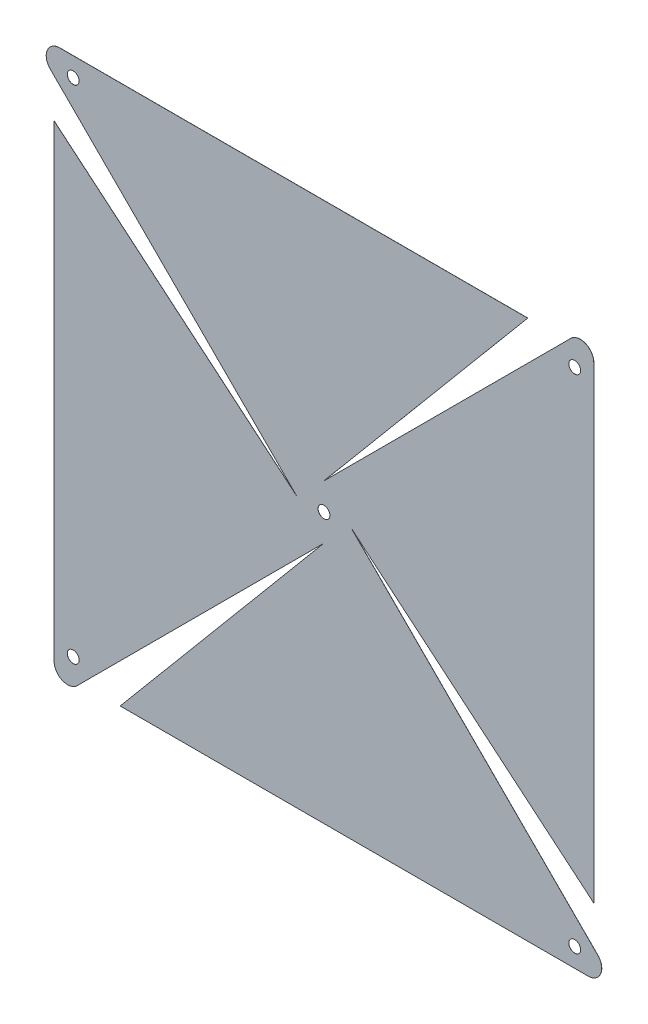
ISO-10303-21;
HEADER;
FILE_DESCRIPTION(('STEP AP214'),'2;1');
FILE_NAME('part.step','',(''),(''),'','','');
FILE_SCHEMA(('AUTOMOTIVE_DESIGN { 1 0 10303 214 1 1 1 1 }'));
ENDSEC;
DATA;
#1=APPLICATION_CONTEXT('core data for automotive mechanical design processes');
#2=APPLICATION_PROTOCOL_DEFINITION('international standard','automotive_design',2000,#1);
#3=PRODUCT_CONTEXT('',#1,'mechanical');
#4=PRODUCT('Part','Part','',(#3));
#5=PRODUCT_RELATED_PRODUCT_CATEGORY('part','',(#4));
#6=PRODUCT_DEFINITION_FORMATION('','',#4);
#7=PRODUCT_DEFINITION_CONTEXT('part definition',#1,'design');
#8=PRODUCT_DEFINITION('design','',#6,#7);
#9=PRODUCT_DEFINITION_SHAPE('','',#8);
#10=(LENGTH_UNIT() NAMED_UNIT(*) SI_UNIT(.MILLI.,.METRE.));
#11=(NAMED_UNIT(*) PLANE_ANGLE_UNIT() SI_UNIT($,.RADIAN.));
#12=(NAMED_UNIT(*) SI_UNIT($,.STERADIAN.) SOLID_ANGLE_UNIT());
#13=UNCERTAINTY_MEASURE_WITH_UNIT(LENGTH_MEASURE(1.E-05),#10,'distance_accuracy_value','');
#14=(GEOMETRIC_REPRESENTATION_CONTEXT(3) GLOBAL_UNCERTAINTY_ASSIGNED_CONTEXT((#13)) GLOBAL_UNIT_ASSIGNED_CONTEXT((#10,
#11,#12)) REPRESENTATION_CONTEXT('',''));
#15=CARTESIAN_POINT('',(0.,0.,0.));
#16=DIRECTION('',(0.,0.,1.));
#17=DIRECTION('',(1.,0.,0.));
#18=AXIS2_PLACEMENT_3D('',#15,#16,#17);
#19=CARTESIAN_POINT('',(0.,0.,0.0254));
#20=DIRECTION('',(0.,0.,1.));
#21=DIRECTION('',(1.,0.,0.));
#22=AXIS2_PLACEMENT_3D('',#19,#20,#21);
#23=PLANE('',#22);
#24=CARTESIAN_POINT('',(-59.0098719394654,-59.0098719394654,0.0254));
#25=DIRECTION('',(0.,0.,1.));
#26=DIRECTION('',(1.,0.,0.));
#27=AXIS2_PLACEMENT_3D('',#24,#25,#26);
#28=CIRCLE('',#27,1.38906249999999);
#29=CARTESIAN_POINT('',(-57.6208094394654,-59.0098719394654,0.0254));
#30=VERTEX_POINT('',#29);
#31=EDGE_CURVE('E428',#30,#30,#28,.T.);
#32=ORIENTED_EDGE('',*,*,#31,.F.);
#33=EDGE_LOOP('',(#32));
#34=FACE_BOUND('',#33,.T.);
#35=CARTESIAN_POINT('',(59.0098719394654,59.0098719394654,0.0254));
#36=DIRECTION('',(0.,0.,1.));
#37=DIRECTION('',(1.,0.,0.));
#38=AXIS2_PLACEMENT_3D('',#35,#36,#37);
#39=CIRCLE('',#38,1.38906249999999);
#40=CARTESIAN_POINT('',(60.3989344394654,59.0098719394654,0.0254));
#41=VERTEX_POINT('',#40);
#42=EDGE_CURVE('E394',#41,#41,#39,.T.);
#43=ORIENTED_EDGE('',*,*,#42,.F.);
#44=EDGE_LOOP('',(#43));
#45=FACE_BOUND('',#44,.T.);
#46=DIRECTION('',(-1.,0.,0.));
#47=VECTOR('',#46,1.);
#48=CARTESIAN_POINT('',(-69.8500000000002,63.5000000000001,0.0254));
#49=LINE('',#48,#47);
#50=CARTESIAN_POINT('',(47.9545439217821,63.5,0.0254));
#51=VERTEX_POINT('',#50);
#52=CARTESIAN_POINT('',(-62.1848719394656,63.5000000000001,0.0254));
#53=VERTEX_POINT('',#52);
#54=EDGE_CURVE('E146',#51,#53,#49,.T.);
#55=ORIENTED_EDGE('',*,*,#54,.T.);
#56=CARTESIAN_POINT('',(-62.1848719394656,60.3250000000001,0.0254));
#57=DIRECTION('',(0.,0.,1.));
#58=DIRECTION('',(1.,0.,0.));
#59=AXIS2_PLACEMENT_3D('',#56,#57,#58);
#60=CIRCLE('',#59,3.175);
#61=CARTESIAN_POINT('',(-64.4299359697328,58.0799359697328,0.0254));
#62=VERTEX_POINT('',#61);
#63=EDGE_CURVE('E194',#53,#62,#60,.T.);
#64=ORIENTED_EDGE('',*,*,#63,.T.);
#65=DIRECTION('',(0.707106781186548,-0.707106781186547,0.));
#66=VECTOR('',#65,1.);
#67=CARTESIAN_POINT('',(-6.35,0.,0.0254));
#68=LINE('',#67,#66);
#69=CARTESIAN_POINT('',(-6.35,0.,0.0254));
#70=VERTEX_POINT('',#69);
#71=EDGE_CURVE('E156',#62,#70,#68,.T.);
#72=ORIENTED_EDGE('',*,*,#71,.T.);
#73=DIRECTION('',(-0.766044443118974,0.642787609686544,0.));
#74=VECTOR('',#73,1.);
#75=CARTESIAN_POINT('',(-6.35,0.,0.0254));
#76=LINE('',#75,#74);
#77=CARTESIAN_POINT('',(-63.5,47.9545439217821,0.0254));
#78=VERTEX_POINT('',#77);
#79=EDGE_CURVE('E289',#70,#78,#76,.T.);
#80=ORIENTED_EDGE('',*,*,#79,.T.);
#81=DIRECTION('',(0.,-1.,0.));
#82=VECTOR('',#81,1.);
#83=CARTESIAN_POINT('',(-63.5000000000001,-69.8500000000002,0.0254));
#84=LINE('',#83,#82);
#85=CARTESIAN_POINT('',(-63.5000000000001,-62.1848719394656,0.0254));
#86=VERTEX_POINT('',#85);
#87=EDGE_CURVE('E245',#78,#86,#84,.T.);
#88=ORIENTED_EDGE('',*,*,#87,.T.);
#89=CARTESIAN_POINT('',(-60.3250000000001,-62.1848719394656,0.0254));
#90=DIRECTION('',(0.,0.,1.));
#91=DIRECTION('',(1.,0.,0.));
#92=AXIS2_PLACEMENT_3D('',#89,#90,#91);
#93=CIRCLE('',#92,3.175);
#94=CARTESIAN_POINT('',(-58.0799359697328,-64.4299359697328,0.0254));
#95=VERTEX_POINT('',#94);
#96=EDGE_CURVE('E192',#86,#95,#93,.T.);
#97=ORIENTED_EDGE('',*,*,#96,.T.);
#98=DIRECTION('',(0.707106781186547,0.707106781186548,0.));
#99=VECTOR('',#98,1.);
#100=CARTESIAN_POINT('',(0.,-6.35,0.0254));
#101=LINE('',#100,#99);
#102=CARTESIAN_POINT('',(0.,-6.35,0.0254));
#103=VERTEX_POINT('',#102);
#104=EDGE_CURVE('E291',#95,#103,#101,.T.);
#105=ORIENTED_EDGE('',*,*,#104,.T.);
#106=DIRECTION('',(-0.642787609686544,-0.766044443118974,0.));
#107=VECTOR('',#106,1.);
#108=CARTESIAN_POINT('',(0.,-6.35,0.0254));
#109=LINE('',#108,#107);
#110=CARTESIAN_POINT('',(-47.9545439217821,-63.5,0.0254));
#111=VERTEX_POINT('',#110);
#112=EDGE_CURVE('E296',#103,#111,#109,.T.);
#113=ORIENTED_EDGE('',*,*,#112,.T.);
#114=DIRECTION('',(1.,0.,0.));
#115=VECTOR('',#114,1.);
#116=CARTESIAN_POINT('',(69.8500000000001,-63.5000000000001,0.0254));
#117=LINE('',#116,#115);
#118=CARTESIAN_POINT('',(62.1848719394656,-63.5000000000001,0.0254));
#119=VERTEX_POINT('',#118);
#120=EDGE_CURVE('E298',#111,#119,#117,.T.);
#121=ORIENTED_EDGE('',*,*,#120,.T.);
#122=CARTESIAN_POINT('',(62.1848719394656,-60.3250000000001,0.0254));
#123=DIRECTION('',(0.,0.,1.));
#124=DIRECTION('',(1.,0.,0.));
#125=AXIS2_PLACEMENT_3D('',#122,#123,#124);
#126=CIRCLE('',#125,3.175);
#127=CARTESIAN_POINT('',(64.4299359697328,-58.0799359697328,0.0254));
#128=VERTEX_POINT('',#127);
#129=EDGE_CURVE('E190',#119,#128,#126,.T.);
#130=ORIENTED_EDGE('',*,*,#129,.T.);
#131=DIRECTION('',(-0.707106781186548,0.707106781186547,0.));
#132=VECTOR('',#131,1.);
#133=CARTESIAN_POINT('',(6.35,0.,0.0254));
#134=LINE('',#133,#132);
#135=CARTESIAN_POINT('',(6.35,0.,0.0254));
#136=VERTEX_POINT('',#135);
#137=EDGE_CURVE('E276',#128,#136,#134,.T.);
#138=ORIENTED_EDGE('',*,*,#137,.T.);
#139=DIRECTION('',(0.766044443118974,-0.642787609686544,0.));
#140=VECTOR('',#139,1.);
#141=CARTESIAN_POINT('',(6.35,0.,0.0254));
#142=LINE('',#141,#140);
#143=CARTESIAN_POINT('',(63.5,-47.9545439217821,0.0254));
#144=VERTEX_POINT('',#143);
#145=EDGE_CURVE('E273',#136,#144,#142,.T.);
#146=ORIENTED_EDGE('',*,*,#145,.T.);
#147=DIRECTION('',(0.,1.,0.));
#148=VECTOR('',#147,1.);
#149=CARTESIAN_POINT('',(63.5000000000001,69.8500000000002,0.0254));
#150=LINE('',#149,#148);
#151=CARTESIAN_POINT('',(63.5000000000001,62.1848719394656,0.0254));
#152=VERTEX_POINT('',#151);
#153=EDGE_CURVE('E272',#144,#152,#150,.T.);
#154=ORIENTED_EDGE('',*,*,#153,.T.);
#155=CARTESIAN_POINT('',(60.3250000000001,62.1848719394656,0.0254));
#156=DIRECTION('',(0.,0.,1.));
#157=DIRECTION('',(1.,0.,0.));
#158=AXIS2_PLACEMENT_3D('',#155,#156,#157);
#159=CIRCLE('',#158,3.175);
#160=CARTESIAN_POINT('',(58.0799359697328,64.4299359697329,0.0254));
#161=VERTEX_POINT('',#160);
#162=EDGE_CURVE('E48',#152,#161,#159,.T.);
#163=ORIENTED_EDGE('',*,*,#162,.T.);
#164=DIRECTION('',(-0.707106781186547,-0.707106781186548,0.));
#165=VECTOR('',#164,1.);
#166=CARTESIAN_POINT('',(0.,6.35,0.0254));
#167=LINE('',#166,#165);
#168=CARTESIAN_POINT('',(0.,6.35,0.0254));
#169=VERTEX_POINT('',#168);
#170=EDGE_CURVE('E161',#161,#169,#167,.T.);
#171=ORIENTED_EDGE('',*,*,#170,.T.);
#172=DIRECTION('',(0.642787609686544,0.766044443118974,0.));
#173=VECTOR('',#172,1.);
#174=CARTESIAN_POINT('',(0.,6.35,0.0254));
#175=LINE('',#174,#173);
#176=EDGE_CURVE('E157',#169,#51,#175,.T.);
#177=ORIENTED_EDGE('',*,*,#176,.T.);
#178=EDGE_LOOP('',(#55,#64,#72,#80,#88,#97,#105,#113,#121,#130,#138,#146,#154,#163,#171,#177));
#179=FACE_BOUND('',#178,.T.);
#180=CARTESIAN_POINT('',(0.,0.,0.0254));
#181=DIRECTION('',(0.,0.,1.));
#182=DIRECTION('',(1.,0.,0.));
#183=AXIS2_PLACEMENT_3D('',#180,#181,#182);
#184=CIRCLE('',#183,1.3890625);
#185=CARTESIAN_POINT('',(1.3890625,0.,0.0254));
#186=VERTEX_POINT('',#185);
#187=EDGE_CURVE('E282',#186,#186,#184,.T.);
#188=ORIENTED_EDGE('',*,*,#187,.F.);
#189=EDGE_LOOP('',(#188));
#190=FACE_BOUND('',#189,.T.);
#191=CARTESIAN_POINT('',(59.0098719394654,-59.0098719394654,0.0254));
#192=DIRECTION('',(0.,0.,1.));
#193=DIRECTION('',(1.,0.,0.));
#194=AXIS2_PLACEMENT_3D('',#191,#192,#193);
#195=CIRCLE('',#194,1.38906249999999);
#196=CARTESIAN_POINT('',(60.3989344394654,-59.0098719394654,0.0254));
#197=VERTEX_POINT('',#196);
#198=EDGE_CURVE('E399',#197,#197,#195,.T.);
#199=ORIENTED_EDGE('',*,*,#198,.F.);
#200=EDGE_LOOP('',(#199));
#201=FACE_BOUND('',#200,.T.);
#202=CARTESIAN_POINT('',(-59.0098719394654,59.0098719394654,0.0254));
#203=DIRECTION('',(0.,0.,1.));
#204=DIRECTION('',(1.,0.,0.));
#205=AXIS2_PLACEMENT_3D('',#202,#203,#204);
#206=CIRCLE('',#205,1.38906249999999);
#207=CARTESIAN_POINT('',(-57.6208094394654,59.0098719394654,0.0254));
#208=VERTEX_POINT('',#207);
#209=EDGE_CURVE('E424',#208,#208,#206,.T.);
#210=ORIENTED_EDGE('',*,*,#209,.F.);
#211=EDGE_LOOP('',(#210));
#212=FACE_BOUND('',#211,.T.);
#213=ADVANCED_FACE('F33',(#34,#45,#179,#190,#201,#212),#23,.T.);
#214=CARTESIAN_POINT('',(0.,0.,0.));
#215=DIRECTION('',(0.,0.,1.));
#216=DIRECTION('',(1.,0.,0.));
#217=AXIS2_PLACEMENT_3D('',#214,#215,#216);
#218=PLANE('',#217);
#219=DIRECTION('',(0.707106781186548,-0.707106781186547,0.));
#220=VECTOR('',#219,1.);
#221=CARTESIAN_POINT('',(-6.35,0.,0.));
#222=LINE('',#221,#220);
#223=CARTESIAN_POINT('',(-64.4299359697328,58.0799359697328,0.));
#224=VERTEX_POINT('',#223);
#225=CARTESIAN_POINT('',(-6.35,0.,0.));
#226=VERTEX_POINT('',#225);
#227=EDGE_CURVE('E255',#224,#226,#222,.T.);
#228=ORIENTED_EDGE('',*,*,#227,.F.);
#229=CARTESIAN_POINT('',(-62.1848719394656,60.3250000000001,0.));
#230=DIRECTION('',(0.,0.,1.));
#231=DIRECTION('',(1.,0.,0.));
#232=AXIS2_PLACEMENT_3D('',#229,#230,#231);
#233=CIRCLE('',#232,3.175);
#234=CARTESIAN_POINT('',(-62.1848719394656,63.5000000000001,0.));
#235=VERTEX_POINT('',#234);
#236=EDGE_CURVE('E186',#224,#235,#233,.F.);
#237=ORIENTED_EDGE('',*,*,#236,.T.);
#238=DIRECTION('',(-1.,0.,0.));
#239=VECTOR('',#238,1.);
#240=CARTESIAN_POINT('',(-69.8500000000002,63.5000000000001,0.));
#241=LINE('',#240,#239);
#242=CARTESIAN_POINT('',(47.9545439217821,63.5,0.));
#243=VERTEX_POINT('',#242);
#244=EDGE_CURVE('E281',#243,#235,#241,.T.);
#245=ORIENTED_EDGE('',*,*,#244,.F.);
#246=DIRECTION('',(0.642787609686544,0.766044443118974,0.));
#247=VECTOR('',#246,1.);
#248=CARTESIAN_POINT('',(0.,6.35,0.));
#249=LINE('',#248,#247);
#250=CARTESIAN_POINT('',(0.,6.35,0.));
#251=VERTEX_POINT('',#250);
#252=EDGE_CURVE('E169',#251,#243,#249,.T.);
#253=ORIENTED_EDGE('',*,*,#252,.F.);
#254=DIRECTION('',(-0.707106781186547,-0.707106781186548,0.));
#255=VECTOR('',#254,1.);
#256=CARTESIAN_POINT('',(0.,6.35,0.));
#257=LINE('',#256,#255);
#258=CARTESIAN_POINT('',(58.0799359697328,64.4299359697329,0.));
#259=VERTEX_POINT('',#258);
#260=EDGE_CURVE('E165',#259,#251,#257,.T.);
#261=ORIENTED_EDGE('',*,*,#260,.F.);
#262=CARTESIAN_POINT('',(60.3250000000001,62.1848719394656,0.));
#263=DIRECTION('',(0.,0.,1.));
#264=DIRECTION('',(1.,0.,0.));
#265=AXIS2_PLACEMENT_3D('',#262,#263,#264);
#266=CIRCLE('',#265,3.175);
#267=CARTESIAN_POINT('',(63.5000000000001,62.1848719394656,0.));
#268=VERTEX_POINT('',#267);
#269=EDGE_CURVE('E174',#259,#268,#266,.F.);
#270=ORIENTED_EDGE('',*,*,#269,.T.);
#271=DIRECTION('',(0.,1.,0.));
#272=VECTOR('',#271,1.);
#273=CARTESIAN_POINT('',(63.5000000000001,69.8500000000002,0.));
#274=LINE('',#273,#272);
#275=CARTESIAN_POINT('',(63.5,-47.9545439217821,0.));
#276=VERTEX_POINT('',#275);
#277=EDGE_CURVE('E216',#276,#268,#274,.T.);
#278=ORIENTED_EDGE('',*,*,#277,.F.);
#279=DIRECTION('',(0.766044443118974,-0.642787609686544,0.));
#280=VECTOR('',#279,1.);
#281=CARTESIAN_POINT('',(6.35,0.,0.));
#282=LINE('',#281,#280);
#283=CARTESIAN_POINT('',(6.35,0.,0.));
#284=VERTEX_POINT('',#283);
#285=EDGE_CURVE('E218',#284,#276,#282,.T.);
#286=ORIENTED_EDGE('',*,*,#285,.F.);
#287=DIRECTION('',(-0.707106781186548,0.707106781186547,0.));
#288=VECTOR('',#287,1.);
#289=CARTESIAN_POINT('',(6.35,0.,0.));
#290=LINE('',#289,#288);
#291=CARTESIAN_POINT('',(64.4299359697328,-58.0799359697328,0.));
#292=VERTEX_POINT('',#291);
#293=EDGE_CURVE('E263',#292,#284,#290,.T.);
#294=ORIENTED_EDGE('',*,*,#293,.F.);
#295=CARTESIAN_POINT('',(62.1848719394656,-60.3250000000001,0.));
#296=DIRECTION('',(0.,0.,1.));
#297=DIRECTION('',(1.,0.,0.));
#298=AXIS2_PLACEMENT_3D('',#295,#296,#297);
#299=CIRCLE('',#298,3.175);
#300=CARTESIAN_POINT('',(62.1848719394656,-63.5000000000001,0.));
#301=VERTEX_POINT('',#300);
#302=EDGE_CURVE('E182',#292,#301,#299,.F.);
#303=ORIENTED_EDGE('',*,*,#302,.T.);
#304=DIRECTION('',(1.,0.,0.));
#305=VECTOR('',#304,1.);
#306=CARTESIAN_POINT('',(69.8500000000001,-63.5000000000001,0.));
#307=LINE('',#306,#305);
#308=CARTESIAN_POINT('',(-47.9545439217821,-63.5,0.));
#309=VERTEX_POINT('',#308);
#310=EDGE_CURVE('E260',#309,#301,#307,.T.);
#311=ORIENTED_EDGE('',*,*,#310,.F.);
#312=DIRECTION('',(-0.642787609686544,-0.766044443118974,0.));
#313=VECTOR('',#312,1.);
#314=CARTESIAN_POINT('',(0.,-6.35,0.));
#315=LINE('',#314,#313);
#316=CARTESIAN_POINT('',(0.,-6.35,0.));
#317=VERTEX_POINT('',#316);
#318=EDGE_CURVE('E253',#317,#309,#315,.T.);
#319=ORIENTED_EDGE('',*,*,#318,.F.);
#320=DIRECTION('',(0.707106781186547,0.707106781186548,0.));
#321=VECTOR('',#320,1.);
#322=CARTESIAN_POINT('',(0.,-6.35,0.));
#323=LINE('',#322,#321);
#324=CARTESIAN_POINT('',(-58.0799359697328,-64.4299359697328,0.));
#325=VERTEX_POINT('',#324);
#326=EDGE_CURVE('E251',#325,#317,#323,.T.);
#327=ORIENTED_EDGE('',*,*,#326,.F.);
#328=CARTESIAN_POINT('',(-60.3250000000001,-62.1848719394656,0.));
#329=DIRECTION('',(0.,0.,1.));
#330=DIRECTION('',(1.,0.,0.));
#331=AXIS2_PLACEMENT_3D('',#328,#329,#330);
#332=CIRCLE('',#331,3.175);
#333=CARTESIAN_POINT('',(-63.5000000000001,-62.1848719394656,0.));
#334=VERTEX_POINT('',#333);
#335=EDGE_CURVE('E184',#325,#334,#332,.F.);
#336=ORIENTED_EDGE('',*,*,#335,.T.);
#337=DIRECTION('',(0.,-1.,0.));
#338=VECTOR('',#337,1.);
#339=CARTESIAN_POINT('',(-63.5000000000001,-69.8500000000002,0.));
#340=LINE('',#339,#338);
#341=CARTESIAN_POINT('',(-63.5,47.9545439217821,0.));
#342=VERTEX_POINT('',#341);
#343=EDGE_CURVE('E242',#342,#334,#340,.T.);
#344=ORIENTED_EDGE('',*,*,#343,.F.);
#345=DIRECTION('',(-0.766044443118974,0.642787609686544,0.));
#346=VECTOR('',#345,1.);
#347=CARTESIAN_POINT('',(-6.35,0.,0.));
#348=LINE('',#347,#346);
#349=EDGE_CURVE('E249',#226,#342,#348,.T.);
#350=ORIENTED_EDGE('',*,*,#349,.F.);
#351=EDGE_LOOP('',(#228,#237,#245,#253,#261,#270,#278,#286,#294,#303,#311,#319,#327,#336,#344,#350));
#352=FACE_BOUND('',#351,.T.);
#353=CARTESIAN_POINT('',(0.,0.,0.));
#354=DIRECTION('',(0.,0.,1.));
#355=DIRECTION('',(1.,0.,0.));
#356=AXIS2_PLACEMENT_3D('',#353,#354,#355);
#357=CIRCLE('',#356,1.3890625);
#358=CARTESIAN_POINT('',(1.3890625,0.,0.));
#359=VERTEX_POINT('',#358);
#360=EDGE_CURVE('E401',#359,#359,#357,.T.);
#361=ORIENTED_EDGE('',*,*,#360,.T.);
#362=EDGE_LOOP('',(#361));
#363=FACE_BOUND('',#362,.T.);
#364=CARTESIAN_POINT('',(59.0098719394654,59.0098719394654,0.));
#365=DIRECTION('',(0.,0.,1.));
#366=DIRECTION('',(1.,0.,0.));
#367=AXIS2_PLACEMENT_3D('',#364,#365,#366);
#368=CIRCLE('',#367,1.38906249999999);
#369=CARTESIAN_POINT('',(60.3989344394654,59.0098719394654,0.));
#370=VERTEX_POINT('',#369);
#371=EDGE_CURVE('E397',#370,#370,#368,.T.);
#372=ORIENTED_EDGE('',*,*,#371,.T.);
#373=EDGE_LOOP('',(#372));
#374=FACE_BOUND('',#373,.T.);
#375=CARTESIAN_POINT('',(59.0098719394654,-59.0098719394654,0.));
#376=DIRECTION('',(0.,0.,1.));
#377=DIRECTION('',(1.,0.,0.));
#378=AXIS2_PLACEMENT_3D('',#375,#376,#377);
#379=CIRCLE('',#378,1.38906249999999);
#380=CARTESIAN_POINT('',(60.3989344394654,-59.0098719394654,0.));
#381=VERTEX_POINT('',#380);
#382=EDGE_CURVE('E404',#381,#381,#379,.T.);
#383=ORIENTED_EDGE('',*,*,#382,.T.);
#384=EDGE_LOOP('',(#383));
#385=FACE_BOUND('',#384,.T.);
#386=CARTESIAN_POINT('',(-59.0098719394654,-59.0098719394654,0.));
#387=DIRECTION('',(0.,0.,1.));
#388=DIRECTION('',(1.,0.,0.));
#389=AXIS2_PLACEMENT_3D('',#386,#387,#388);
#390=CIRCLE('',#389,1.38906249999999);
#391=CARTESIAN_POINT('',(-57.6208094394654,-59.0098719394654,0.));
#392=VERTEX_POINT('',#391);
#393=EDGE_CURVE('E420',#392,#392,#390,.T.);
#394=ORIENTED_EDGE('',*,*,#393,.T.);
#395=EDGE_LOOP('',(#394));
#396=FACE_BOUND('',#395,.T.);
#397=CARTESIAN_POINT('',(-59.0098719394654,59.0098719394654,0.));
#398=DIRECTION('',(0.,0.,1.));
#399=DIRECTION('',(1.,0.,0.));
#400=AXIS2_PLACEMENT_3D('',#397,#398,#399);
#401=CIRCLE('',#400,1.38906249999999);
#402=CARTESIAN_POINT('',(-57.6208094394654,59.0098719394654,0.));
#403=VERTEX_POINT('',#402);
#404=EDGE_CURVE('E423',#403,#403,#401,.T.);
#405=ORIENTED_EDGE('',*,*,#404,.T.);
#406=EDGE_LOOP('',(#405));
#407=FACE_BOUND('',#406,.T.);
#408=ADVANCED_FACE('F213',(#352,#363,#374,#385,#396,#407),#218,.F.);
#409=CARTESIAN_POINT('',(0.,6.35,0.0254));
#410=DIRECTION('',(-0.766044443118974,0.642787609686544,0.));
#411=DIRECTION('',(-0.642787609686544,-0.766044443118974,0.));
#412=AXIS2_PLACEMENT_3D('',#409,#410,#411);
#413=PLANE('',#412);
#414=ORIENTED_EDGE('',*,*,#252,.T.);
#415=DIRECTION('',(0.,0.,-1.));
#416=VECTOR('',#415,1.);
#417=CARTESIAN_POINT('',(47.9545439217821,63.5,0.0254));
#418=LINE('',#417,#416);
#419=EDGE_CURVE('E151',#51,#243,#418,.T.);
#420=ORIENTED_EDGE('',*,*,#419,.F.);
#421=ORIENTED_EDGE('',*,*,#176,.F.);
#422=DIRECTION('',(0.,0.,-1.));
#423=VECTOR('',#422,1.);
#424=CARTESIAN_POINT('',(0.,6.35,0.0254));
#425=LINE('',#424,#423);
#426=EDGE_CURVE('E222',#169,#251,#425,.T.);
#427=ORIENTED_EDGE('',*,*,#426,.T.);
#428=EDGE_LOOP('',(#414,#420,#421,#427));
#429=FACE_BOUND('',#428,.T.);
#430=ADVANCED_FACE('F167',(#429),#413,.F.);
#431=CARTESIAN_POINT('',(-69.8500000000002,63.5000000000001,0.0254));
#432=DIRECTION('',(0.,-1.,0.));
#433=DIRECTION('',(1.,0.,0.));
#434=AXIS2_PLACEMENT_3D('',#431,#432,#433);
#435=PLANE('',#434);
#436=ORIENTED_EDGE('',*,*,#244,.T.);
#437=DIRECTION('',(0.,0.,-1.));
#438=VECTOR('',#437,1.);
#439=CARTESIAN_POINT('',(-62.1848719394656,63.5000000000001,0.0254));
#440=LINE('',#439,#438);
#441=EDGE_CURVE('E154',#235,#53,#440,.F.);
#442=ORIENTED_EDGE('',*,*,#441,.T.);
#443=ORIENTED_EDGE('',*,*,#54,.F.);
#444=ORIENTED_EDGE('',*,*,#419,.T.);
#445=EDGE_LOOP('',(#436,#442,#443,#444));
#446=FACE_BOUND('',#445,.T.);
#447=ADVANCED_FACE('F149',(#446),#435,.F.);
#448=CARTESIAN_POINT('',(-6.35,0.,0.0254));
#449=DIRECTION('',(0.707106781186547,0.707106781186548,0.));
#450=DIRECTION('',(-0.707106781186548,0.707106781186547,0.));
#451=AXIS2_PLACEMENT_3D('',#448,#449,#450);
#452=PLANE('',#451);
#453=ORIENTED_EDGE('',*,*,#71,.F.);
#454=DIRECTION('',(0.,0.,-1.));
#455=VECTOR('',#454,1.);
#456=CARTESIAN_POINT('',(-64.4299359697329,58.0799359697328,0.0254));
#457=LINE('',#456,#455);
#458=EDGE_CURVE('E170',#62,#224,#457,.T.);
#459=ORIENTED_EDGE('',*,*,#458,.T.);
#460=ORIENTED_EDGE('',*,*,#227,.T.);
#461=DIRECTION('',(0.,0.,-1.));
#462=VECTOR('',#461,1.);
#463=CARTESIAN_POINT('',(-6.35,0.,0.0254));
#464=LINE('',#463,#462);
#465=EDGE_CURVE('E171',#70,#226,#464,.T.);
#466=ORIENTED_EDGE('',*,*,#465,.F.);
#467=EDGE_LOOP('',(#453,#459,#460,#466));
#468=FACE_BOUND('',#467,.T.);
#469=ADVANCED_FACE('F286',(#468),#452,.F.);
#470=CARTESIAN_POINT('',(-6.35,0.,0.0254));
#471=DIRECTION('',(-0.642787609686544,-0.766044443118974,0.));
#472=DIRECTION('',(0.766044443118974,-0.642787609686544,0.));
#473=AXIS2_PLACEMENT_3D('',#470,#471,#472);
#474=PLANE('',#473);
#475=ORIENTED_EDGE('',*,*,#349,.T.);
#476=DIRECTION('',(0.,0.,-1.));
#477=VECTOR('',#476,1.);
#478=CARTESIAN_POINT('',(-63.5,47.9545439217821,0.0254));
#479=LINE('',#478,#477);
#480=EDGE_CURVE('E177',#78,#342,#479,.T.);
#481=ORIENTED_EDGE('',*,*,#480,.F.);
#482=ORIENTED_EDGE('',*,*,#79,.F.);
#483=ORIENTED_EDGE('',*,*,#465,.T.);
#484=EDGE_LOOP('',(#475,#481,#482,#483));
#485=FACE_BOUND('',#484,.T.);
#486=ADVANCED_FACE('F288',(#485),#474,.F.);
#487=CARTESIAN_POINT('',(-63.5000000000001,-69.8500000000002,0.0254));
#488=DIRECTION('',(1.,0.,0.));
#489=DIRECTION('',(0.,1.,0.));
#490=AXIS2_PLACEMENT_3D('',#487,#488,#489);
#491=PLANE('',#490);
#492=ORIENTED_EDGE('',*,*,#343,.T.);
#493=DIRECTION('',(0.,0.,-1.));
#494=VECTOR('',#493,1.);
#495=CARTESIAN_POINT('',(-63.5000000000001,-62.1848719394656,0.0254));
#496=LINE('',#495,#494);
#497=EDGE_CURVE('E199',#334,#86,#496,.F.);
#498=ORIENTED_EDGE('',*,*,#497,.T.);
#499=ORIENTED_EDGE('',*,*,#87,.F.);
#500=ORIENTED_EDGE('',*,*,#480,.T.);
#501=EDGE_LOOP('',(#492,#498,#499,#500));
#502=FACE_BOUND('',#501,.T.);
#503=ADVANCED_FACE('F241',(#502),#491,.F.);
#504=CARTESIAN_POINT('',(0.,-6.35,0.0254));
#505=DIRECTION('',(-0.707106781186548,0.707106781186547,0.));
#506=DIRECTION('',(-0.707106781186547,-0.707106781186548,0.));
#507=AXIS2_PLACEMENT_3D('',#504,#505,#506);
#508=PLANE('',#507);
#509=ORIENTED_EDGE('',*,*,#104,.F.);
#510=DIRECTION('',(0.,0.,-1.));
#511=VECTOR('',#510,1.);
#512=CARTESIAN_POINT('',(-58.0799359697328,-64.4299359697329,0.0254));
#513=LINE('',#512,#511);
#514=EDGE_CURVE('E196',#95,#325,#513,.T.);
#515=ORIENTED_EDGE('',*,*,#514,.T.);
#516=ORIENTED_EDGE('',*,*,#326,.T.);
#517=DIRECTION('',(0.,0.,-1.));
#518=VECTOR('',#517,1.);
#519=CARTESIAN_POINT('',(0.,-6.35,0.0254));
#520=LINE('',#519,#518);
#521=EDGE_CURVE('E233',#103,#317,#520,.T.);
#522=ORIENTED_EDGE('',*,*,#521,.F.);
#523=EDGE_LOOP('',(#509,#515,#516,#522));
#524=FACE_BOUND('',#523,.T.);
#525=ADVANCED_FACE('F349',(#524),#508,.F.);
#526=CARTESIAN_POINT('',(0.,-6.35,0.0254));
#527=DIRECTION('',(0.766044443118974,-0.642787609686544,0.));
#528=DIRECTION('',(0.642787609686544,0.766044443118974,0.));
#529=AXIS2_PLACEMENT_3D('',#526,#527,#528);
#530=PLANE('',#529);
#531=ORIENTED_EDGE('',*,*,#318,.T.);
#532=DIRECTION('',(0.,0.,-1.));
#533=VECTOR('',#532,1.);
#534=CARTESIAN_POINT('',(-47.9545439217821,-63.5,0.0254));
#535=LINE('',#534,#533);
#536=EDGE_CURVE('E230',#111,#309,#535,.T.);
#537=ORIENTED_EDGE('',*,*,#536,.F.);
#538=ORIENTED_EDGE('',*,*,#112,.F.);
#539=ORIENTED_EDGE('',*,*,#521,.T.);
#540=EDGE_LOOP('',(#531,#537,#538,#539));
#541=FACE_BOUND('',#540,.T.);
#542=ADVANCED_FACE('F346',(#541),#530,.F.);
#543=CARTESIAN_POINT('',(69.8500000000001,-63.5000000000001,0.0254));
#544=DIRECTION('',(0.,1.,0.));
#545=DIRECTION('',(-1.,0.,0.));
#546=AXIS2_PLACEMENT_3D('',#543,#544,#545);
#547=PLANE('',#546);
#548=ORIENTED_EDGE('',*,*,#310,.T.);
#549=DIRECTION('',(0.,0.,-1.));
#550=VECTOR('',#549,1.);
#551=CARTESIAN_POINT('',(62.1848719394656,-63.5000000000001,0.0254));
#552=LINE('',#551,#550);
#553=EDGE_CURVE('E204',#301,#119,#552,.F.);
#554=ORIENTED_EDGE('',*,*,#553,.T.);
#555=ORIENTED_EDGE('',*,*,#120,.F.);
#556=ORIENTED_EDGE('',*,*,#536,.T.);
#557=EDGE_LOOP('',(#548,#554,#555,#556));
#558=FACE_BOUND('',#557,.T.);
#559=ADVANCED_FACE('F310',(#558),#547,.F.);
#560=CARTESIAN_POINT('',(6.35,0.,0.0254));
#561=DIRECTION('',(-0.707106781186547,-0.707106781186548,0.));
#562=DIRECTION('',(0.707106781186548,-0.707106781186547,0.));
#563=AXIS2_PLACEMENT_3D('',#560,#561,#562);
#564=PLANE('',#563);
#565=ORIENTED_EDGE('',*,*,#137,.F.);
#566=DIRECTION('',(0.,0.,-1.));
#567=VECTOR('',#566,1.);
#568=CARTESIAN_POINT('',(64.4299359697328,-58.0799359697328,0.0254));
#569=LINE('',#568,#567);
#570=EDGE_CURVE('E201',#128,#292,#569,.T.);
#571=ORIENTED_EDGE('',*,*,#570,.T.);
#572=ORIENTED_EDGE('',*,*,#293,.T.);
#573=DIRECTION('',(0.,0.,-1.));
#574=VECTOR('',#573,1.);
#575=CARTESIAN_POINT('',(6.35,0.,0.0254));
#576=LINE('',#575,#574);
#577=EDGE_CURVE('E227',#136,#284,#576,.T.);
#578=ORIENTED_EDGE('',*,*,#577,.F.);
#579=EDGE_LOOP('',(#565,#571,#572,#578));
#580=FACE_BOUND('',#579,.T.);
#581=ADVANCED_FACE('F304',(#580),#564,.F.);
#582=CARTESIAN_POINT('',(6.35,0.,0.0254));
#583=DIRECTION('',(0.642787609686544,0.766044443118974,0.));
#584=DIRECTION('',(-0.766044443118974,0.642787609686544,0.));
#585=AXIS2_PLACEMENT_3D('',#582,#583,#584);
#586=PLANE('',#585);
#587=ORIENTED_EDGE('',*,*,#285,.T.);
#588=DIRECTION('',(0.,0.,-1.));
#589=VECTOR('',#588,1.);
#590=CARTESIAN_POINT('',(63.5,-47.9545439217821,0.0254));
#591=LINE('',#590,#589);
#592=EDGE_CURVE('E224',#144,#276,#591,.T.);
#593=ORIENTED_EDGE('',*,*,#592,.F.);
#594=ORIENTED_EDGE('',*,*,#145,.F.);
#595=ORIENTED_EDGE('',*,*,#577,.T.);
#596=EDGE_LOOP('',(#587,#593,#594,#595));
#597=FACE_BOUND('',#596,.T.);
#598=ADVANCED_FACE('F267',(#597),#586,.F.);
#599=CARTESIAN_POINT('',(63.5000000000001,69.8500000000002,0.0254));
#600=DIRECTION('',(-1.,0.,0.));
#601=DIRECTION('',(0.,-1.,0.));
#602=AXIS2_PLACEMENT_3D('',#599,#600,#601);
#603=PLANE('',#602);
#604=ORIENTED_EDGE('',*,*,#277,.T.);
#605=DIRECTION('',(0.,0.,-1.));
#606=VECTOR('',#605,1.);
#607=CARTESIAN_POINT('',(63.5000000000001,62.1848719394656,0.0254));
#608=LINE('',#607,#606);
#609=EDGE_CURVE('E11',#268,#152,#608,.F.);
#610=ORIENTED_EDGE('',*,*,#609,.T.);
#611=ORIENTED_EDGE('',*,*,#153,.F.);
#612=ORIENTED_EDGE('',*,*,#592,.T.);
#613=EDGE_LOOP('',(#604,#610,#611,#612));
#614=FACE_BOUND('',#613,.T.);
#615=ADVANCED_FACE('F271',(#614),#603,.F.);
#616=CARTESIAN_POINT('',(0.,6.35,0.0254));
#617=DIRECTION('',(0.707106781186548,-0.707106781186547,0.));
#618=DIRECTION('',(0.707106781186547,0.707106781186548,0.));
#619=AXIS2_PLACEMENT_3D('',#616,#617,#618);
#620=PLANE('',#619);
#621=ORIENTED_EDGE('',*,*,#170,.F.);
#622=DIRECTION('',(0.,0.,-1.));
#623=VECTOR('',#622,1.);
#624=CARTESIAN_POINT('',(58.0799359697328,64.4299359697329,0.0254));
#625=LINE('',#624,#623);
#626=EDGE_CURVE('E41',#161,#259,#625,.T.);
#627=ORIENTED_EDGE('',*,*,#626,.T.);
#628=ORIENTED_EDGE('',*,*,#260,.T.);
#629=ORIENTED_EDGE('',*,*,#426,.F.);
#630=EDGE_LOOP('',(#621,#627,#628,#629));
#631=FACE_BOUND('',#630,.T.);
#632=ADVANCED_FACE('F209',(#631),#620,.F.);
#633=CARTESIAN_POINT('',(0.,0.,0.0254));
#634=DIRECTION('',(0.,0.,-1.));
#635=DIRECTION('',(-1.,0.,0.));
#636=AXIS2_PLACEMENT_3D('',#633,#634,#635);
#637=CYLINDRICAL_SURFACE('',#636,1.3890625);
#638=ORIENTED_EDGE('',*,*,#187,.T.);
#639=EDGE_LOOP('',(#638));
#640=FACE_BOUND('',#639,.T.);
#641=ORIENTED_EDGE('',*,*,#360,.F.);
#642=EDGE_LOOP('',(#641));
#643=FACE_BOUND('',#642,.T.);
#644=ADVANCED_FACE('F333',(#640,#643),#637,.F.);
#645=CARTESIAN_POINT('',(59.0098719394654,59.0098719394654,0.0254));
#646=DIRECTION('',(0.,0.,-1.));
#647=DIRECTION('',(-1.,0.,0.));
#648=AXIS2_PLACEMENT_3D('',#645,#646,#647);
#649=CYLINDRICAL_SURFACE('',#648,1.38906249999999);
#650=ORIENTED_EDGE('',*,*,#42,.T.);
#651=EDGE_LOOP('',(#650));
#652=FACE_BOUND('',#651,.T.);
#653=ORIENTED_EDGE('',*,*,#371,.F.);
#654=EDGE_LOOP('',(#653));
#655=FACE_BOUND('',#654,.T.);
#656=ADVANCED_FACE('F383',(#652,#655),#649,.F.);
#657=CARTESIAN_POINT('',(59.0098719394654,-59.0098719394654,0.0254));
#658=DIRECTION('',(0.,0.,-1.));
#659=DIRECTION('',(-1.,0.,0.));
#660=AXIS2_PLACEMENT_3D('',#657,#658,#659);
#661=CYLINDRICAL_SURFACE('',#660,1.38906249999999);
#662=ORIENTED_EDGE('',*,*,#198,.T.);
#663=EDGE_LOOP('',(#662));
#664=FACE_BOUND('',#663,.T.);
#665=ORIENTED_EDGE('',*,*,#382,.F.);
#666=EDGE_LOOP('',(#665));
#667=FACE_BOUND('',#666,.T.);
#668=ADVANCED_FACE('F376',(#664,#667),#661,.F.);
#669=CARTESIAN_POINT('',(-59.0098719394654,-59.0098719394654,0.0254));
#670=DIRECTION('',(0.,0.,-1.));
#671=DIRECTION('',(-1.,0.,0.));
#672=AXIS2_PLACEMENT_3D('',#669,#670,#671);
#673=CYLINDRICAL_SURFACE('',#672,1.38906249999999);
#674=ORIENTED_EDGE('',*,*,#31,.T.);
#675=EDGE_LOOP('',(#674));
#676=FACE_BOUND('',#675,.T.);
#677=ORIENTED_EDGE('',*,*,#393,.F.);
#678=EDGE_LOOP('',(#677));
#679=FACE_BOUND('',#678,.T.);
#680=ADVANCED_FACE('F370',(#676,#679),#673,.F.);
#681=CARTESIAN_POINT('',(-59.0098719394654,59.0098719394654,0.0254));
#682=DIRECTION('',(0.,0.,-1.));
#683=DIRECTION('',(-1.,0.,0.));
#684=AXIS2_PLACEMENT_3D('',#681,#682,#683);
#685=CYLINDRICAL_SURFACE('',#684,1.38906249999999);
#686=ORIENTED_EDGE('',*,*,#209,.T.);
#687=EDGE_LOOP('',(#686));
#688=FACE_BOUND('',#687,.T.);
#689=ORIENTED_EDGE('',*,*,#404,.F.);
#690=EDGE_LOOP('',(#689));
#691=FACE_BOUND('',#690,.T.);
#692=ADVANCED_FACE('F365',(#688,#691),#685,.F.);
#693=CARTESIAN_POINT('',(-62.1848719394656,60.3250000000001,0.0254));
#694=DIRECTION('',(0.,0.,-1.));
#695=DIRECTION('',(-1.,0.,0.));
#696=AXIS2_PLACEMENT_3D('',#693,#694,#695);
#697=CYLINDRICAL_SURFACE('',#696,3.175);
#698=ORIENTED_EDGE('',*,*,#63,.F.);
#699=ORIENTED_EDGE('',*,*,#441,.F.);
#700=ORIENTED_EDGE('',*,*,#236,.F.);
#701=ORIENTED_EDGE('',*,*,#458,.F.);
#702=EDGE_LOOP('',(#698,#699,#700,#701));
#703=FACE_BOUND('',#702,.T.);
#704=ADVANCED_FACE('F320',(#703),#697,.T.);
#705=CARTESIAN_POINT('',(-60.3250000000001,-62.1848719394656,0.0254));
#706=DIRECTION('',(0.,0.,-1.));
#707=DIRECTION('',(-1.,0.,0.));
#708=AXIS2_PLACEMENT_3D('',#705,#706,#707);
#709=CYLINDRICAL_SURFACE('',#708,3.175);
#710=ORIENTED_EDGE('',*,*,#96,.F.);
#711=ORIENTED_EDGE('',*,*,#497,.F.);
#712=ORIENTED_EDGE('',*,*,#335,.F.);
#713=ORIENTED_EDGE('',*,*,#514,.F.);
#714=EDGE_LOOP('',(#710,#711,#712,#713));
#715=FACE_BOUND('',#714,.T.);
#716=ADVANCED_FACE('F315',(#715),#709,.T.);
#717=CARTESIAN_POINT('',(62.1848719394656,-60.3250000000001,0.0254));
#718=DIRECTION('',(0.,0.,-1.));
#719=DIRECTION('',(-1.,0.,0.));
#720=AXIS2_PLACEMENT_3D('',#717,#718,#719);
#721=CYLINDRICAL_SURFACE('',#720,3.175);
#722=ORIENTED_EDGE('',*,*,#129,.F.);
#723=ORIENTED_EDGE('',*,*,#553,.F.);
#724=ORIENTED_EDGE('',*,*,#302,.F.);
#725=ORIENTED_EDGE('',*,*,#570,.F.);
#726=EDGE_LOOP('',(#722,#723,#724,#725));
#727=FACE_BOUND('',#726,.T.);
#728=ADVANCED_FACE('F313',(#727),#721,.T.);
#729=CARTESIAN_POINT('',(60.3250000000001,62.1848719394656,0.0254));
#730=DIRECTION('',(0.,0.,-1.));
#731=DIRECTION('',(-1.,0.,0.));
#732=AXIS2_PLACEMENT_3D('',#729,#730,#731);
#733=CYLINDRICAL_SURFACE('',#732,3.175);
#734=ORIENTED_EDGE('',*,*,#162,.F.);
#735=ORIENTED_EDGE('',*,*,#609,.F.);
#736=ORIENTED_EDGE('',*,*,#269,.F.);
#737=ORIENTED_EDGE('',*,*,#626,.F.);
#738=EDGE_LOOP('',(#734,#735,#736,#737));
#739=FACE_BOUND('',#738,.T.);
#740=ADVANCED_FACE('F35',(#739),#733,.T.);
#741=CLOSED_SHELL('',(#213,#408,#430,#447,#469,#486,#503,#525,#542,#559,#581,#598,#615,#632,
#644,#656,#668,#680,#692,#704,#716,#728,#740));
#742=MANIFOLD_SOLID_BREP('B2',#741);
#743=ADVANCED_BREP_SHAPE_REPRESENTATION('',(#18,#742),#14);
#744=SHAPE_DEFINITION_REPRESENTATION(#9,#743);
ENDSEC;
END-ISO-10303-21;
